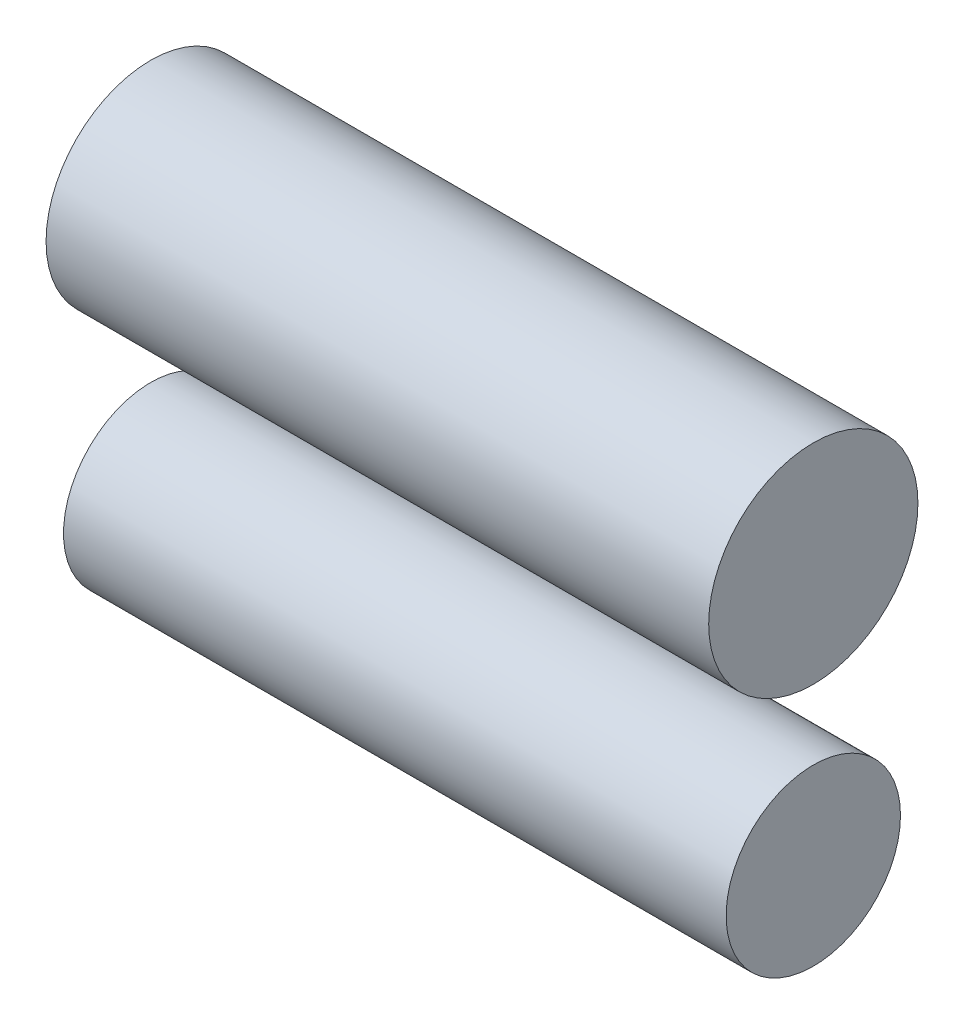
ISO-10303-21;
HEADER;
FILE_DESCRIPTION(('STEP AP214'),'2;1');
FILE_NAME('part.step','',(''),(''),'','','');
FILE_SCHEMA(('AUTOMOTIVE_DESIGN { 1 0 10303 214 1 1 1 1 }'));
ENDSEC;
DATA;
#1=APPLICATION_CONTEXT('core data for automotive mechanical design processes');
#2=APPLICATION_PROTOCOL_DEFINITION('international standard','automotive_design',2000,#1);
#3=PRODUCT_CONTEXT('',#1,'mechanical');
#4=PRODUCT('Part','Part','',(#3));
#5=PRODUCT_RELATED_PRODUCT_CATEGORY('part','',(#4));
#6=PRODUCT_DEFINITION_FORMATION('','',#4);
#7=PRODUCT_DEFINITION_CONTEXT('part definition',#1,'design');
#8=PRODUCT_DEFINITION('design','',#6,#7);
#9=PRODUCT_DEFINITION_SHAPE('','',#8);
#10=(LENGTH_UNIT() NAMED_UNIT(*) SI_UNIT(.MILLI.,.METRE.));
#11=(NAMED_UNIT(*) PLANE_ANGLE_UNIT() SI_UNIT($,.RADIAN.));
#12=(NAMED_UNIT(*) SI_UNIT($,.STERADIAN.) SOLID_ANGLE_UNIT());
#13=UNCERTAINTY_MEASURE_WITH_UNIT(LENGTH_MEASURE(1.E-05),#10,'distance_accuracy_value','');
#14=(GEOMETRIC_REPRESENTATION_CONTEXT(3) GLOBAL_UNCERTAINTY_ASSIGNED_CONTEXT((#13)) GLOBAL_UNIT_ASSIGNED_CONTEXT((#10,
#11,#12)) REPRESENTATION_CONTEXT('',''));
#15=CARTESIAN_POINT('',(0.,0.,0.));
#16=DIRECTION('',(0.,0.,1.));
#17=DIRECTION('',(1.,0.,0.));
#18=AXIS2_PLACEMENT_3D('',#15,#16,#17);
#19=CARTESIAN_POINT('',(-38.7,0.,-107.5));
#20=DIRECTION('',(-1.,0.,0.));
#21=DIRECTION('',(0.,0.,1.));
#22=AXIS2_PLACEMENT_3D('',#19,#20,#21);
#23=PLANE('',#22);
#24=CARTESIAN_POINT('',(-38.7,0.,-107.5));
#25=DIRECTION('',(1.,0.,0.));
#26=DIRECTION('',(0.,0.,-1.));
#27=AXIS2_PLACEMENT_3D('',#24,#25,#26);
#28=CIRCLE('',#27,3.);
#29=CARTESIAN_POINT('',(-38.7,0.,-110.5));
#30=VERTEX_POINT('',#29);
#31=EDGE_CURVE('P0_E17',#30,#30,#28,.T.);
#32=ORIENTED_EDGE('',*,*,#31,.F.);
#33=EDGE_LOOP('',(#32));
#34=FACE_BOUND('',#33,.T.);
#35=ADVANCED_FACE('P0_F14',(#34),#23,.T.);
#36=CARTESIAN_POINT('',(-19.7,0.,-107.5));
#37=DIRECTION('',(-1.,0.,0.));
#38=DIRECTION('',(0.,0.,1.));
#39=AXIS2_PLACEMENT_3D('',#36,#37,#38);
#40=PLANE('',#39);
#41=CARTESIAN_POINT('',(-19.7,0.,-107.5));
#42=DIRECTION('',(1.,0.,0.));
#43=DIRECTION('',(0.,0.,-1.));
#44=AXIS2_PLACEMENT_3D('',#41,#42,#43);
#45=CIRCLE('',#44,3.);
#46=CARTESIAN_POINT('',(-19.7,0.,-110.5));
#47=VERTEX_POINT('',#46);
#48=EDGE_CURVE('P0_E10',#47,#47,#45,.F.);
#49=ORIENTED_EDGE('',*,*,#48,.F.);
#50=EDGE_LOOP('',(#49));
#51=FACE_BOUND('',#50,.T.);
#52=ADVANCED_FACE('P0_F29',(#51),#40,.F.);
#53=CARTESIAN_POINT('',(-38.7,0.,-107.5));
#54=DIRECTION('',(1.,0.,0.));
#55=DIRECTION('',(0.,0.,-1.));
#56=AXIS2_PLACEMENT_3D('',#53,#54,#55);
#57=CYLINDRICAL_SURFACE('',#56,3.);
#58=ORIENTED_EDGE('',*,*,#48,.T.);
#59=EDGE_LOOP('',(#58));
#60=FACE_BOUND('',#59,.T.);
#61=ORIENTED_EDGE('',*,*,#31,.T.);
#62=EDGE_LOOP('',(#61));
#63=FACE_BOUND('',#62,.T.);
#64=ADVANCED_FACE('P0_F26',(#60,#63),#57,.T.);
#65=CLOSED_SHELL('',(#35,#52,#64));
#66=MANIFOLD_SOLID_BREP('P0_B1',#65);
#67=CARTESIAN_POINT('',(-38.7,-7.5,-107.5));
#68=DIRECTION('',(-1.,0.,0.));
#69=DIRECTION('',(0.,0.,1.));
#70=AXIS2_PLACEMENT_3D('',#67,#68,#69);
#71=PLANE('',#70);
#72=CARTESIAN_POINT('',(-38.7,-7.5,-107.5));
#73=DIRECTION('',(1.,0.,0.));
#74=DIRECTION('',(0.,0.,-1.));
#75=AXIS2_PLACEMENT_3D('',#72,#73,#74);
#76=CIRCLE('',#75,2.5);
#77=CARTESIAN_POINT('',(-38.7,-7.5,-110.));
#78=VERTEX_POINT('',#77);
#79=EDGE_CURVE('P1_E17',#78,#78,#76,.T.);
#80=ORIENTED_EDGE('',*,*,#79,.F.);
#81=EDGE_LOOP('',(#80));
#82=FACE_BOUND('',#81,.T.);
#83=ADVANCED_FACE('P1_F14',(#82),#71,.T.);
#84=CARTESIAN_POINT('',(-19.7,-7.5,-107.5));
#85=DIRECTION('',(-1.,0.,0.));
#86=DIRECTION('',(0.,0.,1.));
#87=AXIS2_PLACEMENT_3D('',#84,#85,#86);
#88=PLANE('',#87);
#89=CARTESIAN_POINT('',(-19.7,-7.5,-107.5));
#90=DIRECTION('',(1.,0.,0.));
#91=DIRECTION('',(0.,0.,-1.));
#92=AXIS2_PLACEMENT_3D('',#89,#90,#91);
#93=CIRCLE('',#92,2.5);
#94=CARTESIAN_POINT('',(-19.7,-7.5,-110.));
#95=VERTEX_POINT('',#94);
#96=EDGE_CURVE('P1_E10',#95,#95,#93,.F.);
#97=ORIENTED_EDGE('',*,*,#96,.F.);
#98=EDGE_LOOP('',(#97));
#99=FACE_BOUND('',#98,.T.);
#100=ADVANCED_FACE('P1_F29',(#99),#88,.F.);
#101=CARTESIAN_POINT('',(-38.7,-7.5,-107.5));
#102=DIRECTION('',(1.,0.,0.));
#103=DIRECTION('',(0.,0.,-1.));
#104=AXIS2_PLACEMENT_3D('',#101,#102,#103);
#105=CYLINDRICAL_SURFACE('',#104,2.5);
#106=ORIENTED_EDGE('',*,*,#96,.T.);
#107=EDGE_LOOP('',(#106));
#108=FACE_BOUND('',#107,.T.);
#109=ORIENTED_EDGE('',*,*,#79,.T.);
#110=EDGE_LOOP('',(#109));
#111=FACE_BOUND('',#110,.T.);
#112=ADVANCED_FACE('P1_F26',(#108,#111),#105,.T.);
#113=CLOSED_SHELL('',(#83,#100,#112));
#114=MANIFOLD_SOLID_BREP('P1_B1',#113);
#115=ADVANCED_BREP_SHAPE_REPRESENTATION('',(#18,#66,#114),#14);
#116=SHAPE_DEFINITION_REPRESENTATION(#9,#115);
ENDSEC;
END-ISO-10303-21;
